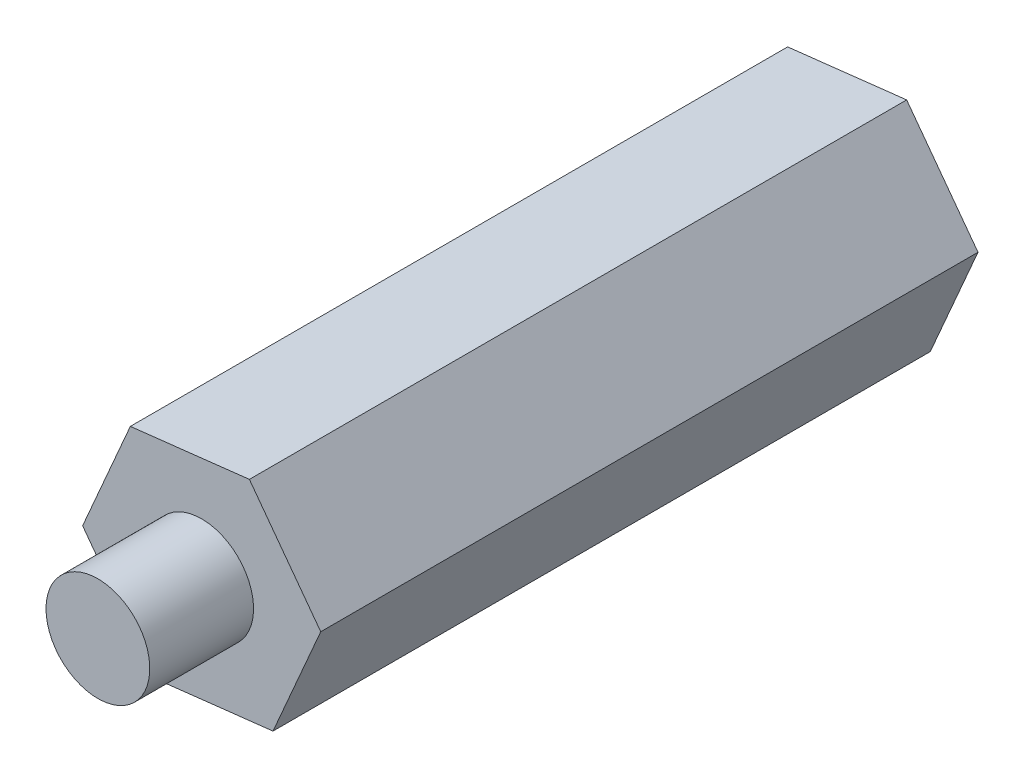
ISO-10303-21;
HEADER;
FILE_DESCRIPTION(('STEP AP214'),'2;1');
FILE_NAME('part.step','',(''),(''),'','','');
FILE_SCHEMA(('AUTOMOTIVE_DESIGN { 1 0 10303 214 1 1 1 1 }'));
ENDSEC;
DATA;
#1=APPLICATION_CONTEXT('core data for automotive mechanical design processes');
#2=APPLICATION_PROTOCOL_DEFINITION('international standard','automotive_design',2000,#1);
#3=PRODUCT_CONTEXT('',#1,'mechanical');
#4=PRODUCT('Part','Part','',(#3));
#5=PRODUCT_RELATED_PRODUCT_CATEGORY('part','',(#4));
#6=PRODUCT_DEFINITION_FORMATION('','',#4);
#7=PRODUCT_DEFINITION_CONTEXT('part definition',#1,'design');
#8=PRODUCT_DEFINITION('design','',#6,#7);
#9=PRODUCT_DEFINITION_SHAPE('','',#8);
#10=(LENGTH_UNIT() NAMED_UNIT(*) SI_UNIT(.MILLI.,.METRE.));
#11=(NAMED_UNIT(*) PLANE_ANGLE_UNIT() SI_UNIT($,.RADIAN.));
#12=(NAMED_UNIT(*) SI_UNIT($,.STERADIAN.) SOLID_ANGLE_UNIT());
#13=UNCERTAINTY_MEASURE_WITH_UNIT(LENGTH_MEASURE(1.E-05),#10,'distance_accuracy_value','');
#14=(GEOMETRIC_REPRESENTATION_CONTEXT(3) GLOBAL_UNCERTAINTY_ASSIGNED_CONTEXT((#13)) GLOBAL_UNIT_ASSIGNED_CONTEXT((#10,
#11,#12)) REPRESENTATION_CONTEXT('',''));
#15=CARTESIAN_POINT('',(0.,0.,0.));
#16=DIRECTION('',(0.,0.,1.));
#17=DIRECTION('',(1.,0.,0.));
#18=AXIS2_PLACEMENT_3D('',#15,#16,#17);
#19=CARTESIAN_POINT('',(-12.3364992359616,0.996816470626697,44.));
#20=DIRECTION('',(0.,0.,1.));
#21=DIRECTION('',(1.,0.,0.));
#22=AXIS2_PLACEMENT_3D('',#19,#20,#21);
#23=PLANE('',#22);
#24=CARTESIAN_POINT('',(-12.3364992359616,0.996816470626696,44.));
#25=DIRECTION('',(0.,0.,-1.));
#26=DIRECTION('',(-1.,0.,0.));
#27=AXIS2_PLACEMENT_3D('',#24,#25,#26);
#28=CIRCLE('',#27,3.);
#29=CARTESIAN_POINT('',(-15.3364992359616,0.996816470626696,44.));
#30=VERTEX_POINT('',#29);
#31=EDGE_CURVE('E20',#30,#30,#28,.T.);
#32=ORIENTED_EDGE('',*,*,#31,.F.);
#33=EDGE_LOOP('',(#32));
#34=FACE_BOUND('',#33,.T.);
#35=ADVANCED_FACE('F16',(#34),#23,.T.);
#36=CARTESIAN_POINT('',(-12.3364992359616,0.996816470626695,13.));
#37=DIRECTION('',(0.,0.,-1.));
#38=DIRECTION('',(0.,1.,0.));
#39=AXIS2_PLACEMENT_3D('',#36,#37,#38);
#40=CONICAL_SURFACE('',#39,3.,1.02974425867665);
#41=CARTESIAN_POINT('',(-12.3364992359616,0.996816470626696,14.8025818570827));
#42=VERTEX_POINT('',#41);
#43=VERTEX_LOOP('',#42);
#44=FACE_BOUND('',#43,.T.);
#45=CARTESIAN_POINT('',(-12.3364992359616,0.996816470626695,13.));
#46=DIRECTION('',(0.,0.,-1.));
#47=DIRECTION('',(0.,1.,0.));
#48=AXIS2_PLACEMENT_3D('',#45,#46,#47);
#49=CIRCLE('',#48,3.);
#50=CARTESIAN_POINT('',(-12.3364992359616,3.99681647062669,13.));
#51=VERTEX_POINT('',#50);
#52=EDGE_CURVE('E79',#51,#51,#49,.T.);
#53=ORIENTED_EDGE('',*,*,#52,.T.);
#54=EDGE_LOOP('',(#53));
#55=FACE_BOUND('',#54,.T.);
#56=ADVANCED_FACE('F213',(#44,#55),#40,.F.);
#57=CARTESIAN_POINT('',(-12.3364992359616,0.996816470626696,44.));
#58=DIRECTION('',(0.,0.,-1.));
#59=DIRECTION('',(-1.,0.,0.));
#60=AXIS2_PLACEMENT_3D('',#57,#58,#59);
#61=CYLINDRICAL_SURFACE('',#60,3.);
#62=ORIENTED_EDGE('',*,*,#31,.T.);
#63=EDGE_LOOP('',(#62));
#64=FACE_BOUND('',#63,.T.);
#65=CARTESIAN_POINT('',(-12.3364992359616,0.996816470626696,38.));
#66=DIRECTION('',(0.,0.,-1.));
#67=DIRECTION('',(-1.,0.,0.));
#68=AXIS2_PLACEMENT_3D('',#65,#66,#67);
#69=CIRCLE('',#68,3.);
#70=CARTESIAN_POINT('',(-15.3364992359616,0.996816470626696,38.));
#71=VERTEX_POINT('',#70);
#72=EDGE_CURVE('E105',#71,#71,#69,.T.);
#73=ORIENTED_EDGE('',*,*,#72,.F.);
#74=EDGE_LOOP('',(#73));
#75=FACE_BOUND('',#74,.T.);
#76=ADVANCED_FACE('F206',(#64,#75),#61,.T.);
#77=CARTESIAN_POINT('',(-15.0955497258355,-5.35831062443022,0.));
#78=DIRECTION('',(-0.803523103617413,-0.595273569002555,0.));
#79=DIRECTION('',(0.595273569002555,-0.803523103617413,0.));
#80=AXIS2_PLACEMENT_3D('',#77,#78,#79);
#81=PLANE('',#80);
#82=DIRECTION('',(0.595273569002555,-0.803523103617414,0.));
#83=VECTOR('',#82,1.);
#84=CARTESIAN_POINT('',(-19.2197259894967,0.20866073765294,0.));
#85=LINE('',#84,#83);
#86=CARTESIAN_POINT('',(-19.2197259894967,0.208660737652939,0.));
#87=VERTEX_POINT('',#86);
#88=CARTESIAN_POINT('',(-15.0955497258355,-5.35831062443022,0.));
#89=VERTEX_POINT('',#88);
#90=EDGE_CURVE('E113',#87,#89,#85,.T.);
#91=ORIENTED_EDGE('',*,*,#90,.T.);
#92=DIRECTION('',(0.,0.,1.));
#93=VECTOR('',#92,1.);
#94=CARTESIAN_POINT('',(-15.0955497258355,-5.35831062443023,0.));
#95=LINE('',#94,#93);
#96=CARTESIAN_POINT('',(-15.0955497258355,-5.35831062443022,38.));
#97=VERTEX_POINT('',#96);
#98=EDGE_CURVE('E85',#97,#89,#95,.F.);
#99=ORIENTED_EDGE('',*,*,#98,.F.);
#100=DIRECTION('',(0.595273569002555,-0.803523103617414,0.));
#101=VECTOR('',#100,1.);
#102=CARTESIAN_POINT('',(-19.2197259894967,0.20866073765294,38.));
#103=LINE('',#102,#101);
#104=CARTESIAN_POINT('',(-19.2197259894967,0.208660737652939,38.));
#105=VERTEX_POINT('',#104);
#106=EDGE_CURVE('E82',#105,#97,#103,.T.);
#107=ORIENTED_EDGE('',*,*,#106,.F.);
#108=DIRECTION('',(0.,0.,1.));
#109=VECTOR('',#108,1.);
#110=CARTESIAN_POINT('',(-19.2197259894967,0.20866073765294,0.));
#111=LINE('',#110,#109);
#112=EDGE_CURVE('E69',#87,#105,#111,.T.);
#113=ORIENTED_EDGE('',*,*,#112,.F.);
#114=EDGE_LOOP('',(#91,#99,#107,#113));
#115=FACE_BOUND('',#114,.T.);
#116=ADVANCED_FACE('F83',(#115),#81,.T.);
#117=CARTESIAN_POINT('',(-19.2197259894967,0.20866073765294,0.));
#118=DIRECTION('',(-0.91728358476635,0.398234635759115,0.));
#119=DIRECTION('',(-0.398234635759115,-0.91728358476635,0.));
#120=AXIS2_PLACEMENT_3D('',#117,#118,#119);
#121=PLANE('',#120);
#122=DIRECTION('',(-0.398234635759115,-0.91728358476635,0.));
#123=VECTOR('',#122,1.);
#124=CARTESIAN_POINT('',(-16.4606754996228,6.56378783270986,0.));
#125=LINE('',#124,#123);
#126=CARTESIAN_POINT('',(-16.4606754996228,6.56378783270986,0.));
#127=VERTEX_POINT('',#126);
#128=EDGE_CURVE('E76',#127,#87,#125,.T.);
#129=ORIENTED_EDGE('',*,*,#128,.T.);
#130=ORIENTED_EDGE('',*,*,#112,.T.);
#131=DIRECTION('',(-0.398234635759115,-0.91728358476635,0.));
#132=VECTOR('',#131,1.);
#133=CARTESIAN_POINT('',(-16.4606754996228,6.56378783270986,38.));
#134=LINE('',#133,#132);
#135=CARTESIAN_POINT('',(-16.4606754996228,6.56378783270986,38.));
#136=VERTEX_POINT('',#135);
#137=EDGE_CURVE('E73',#136,#105,#134,.T.);
#138=ORIENTED_EDGE('',*,*,#137,.F.);
#139=DIRECTION('',(0.,0.,1.));
#140=VECTOR('',#139,1.);
#141=CARTESIAN_POINT('',(-16.4606754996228,6.56378783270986,0.));
#142=LINE('',#141,#140);
#143=EDGE_CURVE('E93',#127,#136,#142,.T.);
#144=ORIENTED_EDGE('',*,*,#143,.F.);
#145=EDGE_LOOP('',(#129,#130,#138,#144));
#146=FACE_BOUND('',#145,.T.);
#147=ADVANCED_FACE('F71',(#146),#121,.T.);
#148=CARTESIAN_POINT('',(-12.3364992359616,0.996816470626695,0.));
#149=DIRECTION('',(0.,0.,1.));
#150=DIRECTION('',(1.,0.,0.));
#151=AXIS2_PLACEMENT_3D('',#148,#149,#150);
#152=CYLINDRICAL_SURFACE('',#151,3.);
#153=ORIENTED_EDGE('',*,*,#52,.F.);
#154=EDGE_LOOP('',(#153));
#155=FACE_BOUND('',#154,.T.);
#156=CARTESIAN_POINT('',(-12.3364992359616,0.996816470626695,0.));
#157=DIRECTION('',(0.,0.,1.));
#158=DIRECTION('',(1.,0.,0.));
#159=AXIS2_PLACEMENT_3D('',#156,#157,#158);
#160=CIRCLE('',#159,3.);
#161=CARTESIAN_POINT('',(-9.33649923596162,0.996816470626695,0.));
#162=VERTEX_POINT('',#161);
#163=EDGE_CURVE('E102',#162,#162,#160,.F.);
#164=ORIENTED_EDGE('',*,*,#163,.T.);
#165=EDGE_LOOP('',(#164));
#166=FACE_BOUND('',#165,.T.);
#167=ADVANCED_FACE('F18',(#155,#166),#152,.F.);
#168=CARTESIAN_POINT('',(-16.4606754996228,6.56378783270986,0.));
#169=DIRECTION('',(-0.113760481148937,0.993508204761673,0.));
#170=DIRECTION('',(-0.993508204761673,-0.113760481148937,0.));
#171=AXIS2_PLACEMENT_3D('',#168,#169,#170);
#172=PLANE('',#171);
#173=DIRECTION('',(-0.993508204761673,-0.113760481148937,0.));
#174=VECTOR('',#173,1.);
#175=CARTESIAN_POINT('',(-9.57744874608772,7.35194356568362,0.));
#176=LINE('',#175,#174);
#177=CARTESIAN_POINT('',(-9.57744874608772,7.35194356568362,0.));
#178=VERTEX_POINT('',#177);
#179=EDGE_CURVE('E117',#178,#127,#176,.T.);
#180=ORIENTED_EDGE('',*,*,#179,.T.);
#181=ORIENTED_EDGE('',*,*,#143,.T.);
#182=DIRECTION('',(-0.993508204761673,-0.113760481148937,0.));
#183=VECTOR('',#182,1.);
#184=CARTESIAN_POINT('',(-9.57744874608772,7.35194356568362,38.));
#185=LINE('',#184,#183);
#186=CARTESIAN_POINT('',(-9.57744874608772,7.35194356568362,38.));
#187=VERTEX_POINT('',#186);
#188=EDGE_CURVE('E88',#187,#136,#185,.T.);
#189=ORIENTED_EDGE('',*,*,#188,.F.);
#190=DIRECTION('',(0.,0.,1.));
#191=VECTOR('',#190,1.);
#192=CARTESIAN_POINT('',(-9.57744874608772,7.35194356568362,0.));
#193=LINE('',#192,#191);
#194=EDGE_CURVE('E124',#178,#187,#193,.T.);
#195=ORIENTED_EDGE('',*,*,#194,.F.);
#196=EDGE_LOOP('',(#180,#181,#189,#195));
#197=FACE_BOUND('',#196,.T.);
#198=ADVANCED_FACE('F145',(#197),#172,.T.);
#199=CARTESIAN_POINT('',(-12.3364992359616,0.996816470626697,38.));
#200=DIRECTION('',(0.,0.,1.));
#201=DIRECTION('',(1.,0.,0.));
#202=AXIS2_PLACEMENT_3D('',#199,#200,#201);
#203=PLANE('',#202);
#204=ORIENTED_EDGE('',*,*,#72,.T.);
#205=EDGE_LOOP('',(#204));
#206=FACE_BOUND('',#205,.T.);
#207=DIRECTION('',(-0.595273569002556,0.803523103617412,0.));
#208=VECTOR('',#207,1.);
#209=CARTESIAN_POINT('',(-9.57744874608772,7.35194356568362,38.));
#210=LINE('',#209,#208);
#211=CARTESIAN_POINT('',(-5.45327248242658,1.78497220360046,38.));
#212=VERTEX_POINT('',#211);
#213=EDGE_CURVE('E104',#187,#212,#210,.F.);
#214=ORIENTED_EDGE('',*,*,#213,.F.);
#215=ORIENTED_EDGE('',*,*,#188,.T.);
#216=ORIENTED_EDGE('',*,*,#137,.T.);
#217=ORIENTED_EDGE('',*,*,#106,.T.);
#218=DIRECTION('',(0.993508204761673,0.113760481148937,0.));
#219=VECTOR('',#218,1.);
#220=CARTESIAN_POINT('',(-8.21232297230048,-4.57015489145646,38.));
#221=LINE('',#220,#219);
#222=CARTESIAN_POINT('',(-8.21232297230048,-4.57015489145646,38.));
#223=VERTEX_POINT('',#222);
#224=EDGE_CURVE('E107',#223,#97,#221,.F.);
#225=ORIENTED_EDGE('',*,*,#224,.F.);
#226=DIRECTION('',(0.398234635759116,0.917283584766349,0.));
#227=VECTOR('',#226,1.);
#228=CARTESIAN_POINT('',(-5.45327248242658,1.78497220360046,38.));
#229=LINE('',#228,#227);
#230=EDGE_CURVE('E127',#212,#223,#229,.F.);
#231=ORIENTED_EDGE('',*,*,#230,.F.);
#232=EDGE_LOOP('',(#214,#215,#216,#217,#225,#231));
#233=FACE_BOUND('',#232,.T.);
#234=ADVANCED_FACE('F92',(#206,#233),#203,.T.);
#235=CARTESIAN_POINT('',(-8.21232297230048,-4.57015489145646,0.));
#236=DIRECTION('',(0.113760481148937,-0.993508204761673,0.));
#237=DIRECTION('',(0.993508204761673,0.113760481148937,0.));
#238=AXIS2_PLACEMENT_3D('',#235,#236,#237);
#239=PLANE('',#238);
#240=DIRECTION('',(0.993508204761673,0.113760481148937,0.));
#241=VECTOR('',#240,1.);
#242=CARTESIAN_POINT('',(-15.0955497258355,-5.35831062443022,0.));
#243=LINE('',#242,#241);
#244=CARTESIAN_POINT('',(-8.21232297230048,-4.57015489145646,0.));
#245=VERTEX_POINT('',#244);
#246=EDGE_CURVE('E115',#89,#245,#243,.T.);
#247=ORIENTED_EDGE('',*,*,#246,.T.);
#248=DIRECTION('',(0.,0.,1.));
#249=VECTOR('',#248,1.);
#250=CARTESIAN_POINT('',(-8.21232297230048,-4.57015489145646,0.));
#251=LINE('',#250,#249);
#252=EDGE_CURVE('E130',#223,#245,#251,.F.);
#253=ORIENTED_EDGE('',*,*,#252,.F.);
#254=ORIENTED_EDGE('',*,*,#224,.T.);
#255=ORIENTED_EDGE('',*,*,#98,.T.);
#256=EDGE_LOOP('',(#247,#253,#254,#255));
#257=FACE_BOUND('',#256,.T.);
#258=ADVANCED_FACE('F140',(#257),#239,.T.);
#259=CARTESIAN_POINT('',(-12.3364992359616,0.996816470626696,0.));
#260=DIRECTION('',(0.,0.,1.));
#261=DIRECTION('',(1.,0.,0.));
#262=AXIS2_PLACEMENT_3D('',#259,#260,#261);
#263=PLANE('',#262);
#264=ORIENTED_EDGE('',*,*,#163,.F.);
#265=EDGE_LOOP('',(#264));
#266=FACE_BOUND('',#265,.T.);
#267=ORIENTED_EDGE('',*,*,#179,.F.);
#268=DIRECTION('',(-0.595273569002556,0.803523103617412,0.));
#269=VECTOR('',#268,1.);
#270=CARTESIAN_POINT('',(-9.57744874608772,7.35194356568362,0.));
#271=LINE('',#270,#269);
#272=CARTESIAN_POINT('',(-5.45327248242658,1.78497220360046,0.));
#273=VERTEX_POINT('',#272);
#274=EDGE_CURVE('E35',#273,#178,#271,.T.);
#275=ORIENTED_EDGE('',*,*,#274,.F.);
#276=DIRECTION('',(0.398234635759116,0.917283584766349,0.));
#277=VECTOR('',#276,1.);
#278=CARTESIAN_POINT('',(-5.45327248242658,1.78497220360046,0.));
#279=LINE('',#278,#277);
#280=EDGE_CURVE('E26',#245,#273,#279,.T.);
#281=ORIENTED_EDGE('',*,*,#280,.F.);
#282=ORIENTED_EDGE('',*,*,#246,.F.);
#283=ORIENTED_EDGE('',*,*,#90,.F.);
#284=ORIENTED_EDGE('',*,*,#128,.F.);
#285=EDGE_LOOP('',(#267,#275,#281,#282,#283,#284));
#286=FACE_BOUND('',#285,.T.);
#287=ADVANCED_FACE('F138',(#266,#286),#263,.F.);
#288=CARTESIAN_POINT('',(-9.57744874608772,7.35194356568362,0.));
#289=DIRECTION('',(0.803523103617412,0.595273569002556,0.));
#290=DIRECTION('',(-0.595273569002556,0.803523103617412,0.));
#291=AXIS2_PLACEMENT_3D('',#288,#289,#290);
#292=PLANE('',#291);
#293=ORIENTED_EDGE('',*,*,#274,.T.);
#294=ORIENTED_EDGE('',*,*,#194,.T.);
#295=ORIENTED_EDGE('',*,*,#213,.T.);
#296=DIRECTION('',(0.,0.,1.));
#297=VECTOR('',#296,1.);
#298=CARTESIAN_POINT('',(-5.45327248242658,1.78497220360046,0.));
#299=LINE('',#298,#297);
#300=EDGE_CURVE('E11',#273,#212,#299,.T.);
#301=ORIENTED_EDGE('',*,*,#300,.F.);
#302=EDGE_LOOP('',(#293,#294,#295,#301));
#303=FACE_BOUND('',#302,.T.);
#304=ADVANCED_FACE('F142',(#303),#292,.T.);
#305=CARTESIAN_POINT('',(-5.45327248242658,1.78497220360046,0.));
#306=DIRECTION('',(0.917283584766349,-0.398234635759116,0.));
#307=DIRECTION('',(0.398234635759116,0.917283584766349,0.));
#308=AXIS2_PLACEMENT_3D('',#305,#306,#307);
#309=PLANE('',#308);
#310=ORIENTED_EDGE('',*,*,#280,.T.);
#311=ORIENTED_EDGE('',*,*,#300,.T.);
#312=ORIENTED_EDGE('',*,*,#230,.T.);
#313=ORIENTED_EDGE('',*,*,#252,.T.);
#314=EDGE_LOOP('',(#310,#311,#312,#313));
#315=FACE_BOUND('',#314,.T.);
#316=ADVANCED_FACE('F135',(#315),#309,.T.);
#317=CLOSED_SHELL('',(#35,#56,#76,#116,#147,#167,#198,#234,#258,#287,#304,#316));
#318=MANIFOLD_SOLID_BREP('B1',#317);
#319=ADVANCED_BREP_SHAPE_REPRESENTATION('',(#18,#318),#14);
#320=SHAPE_DEFINITION_REPRESENTATION(#9,#319);
ENDSEC;
END-ISO-10303-21;
